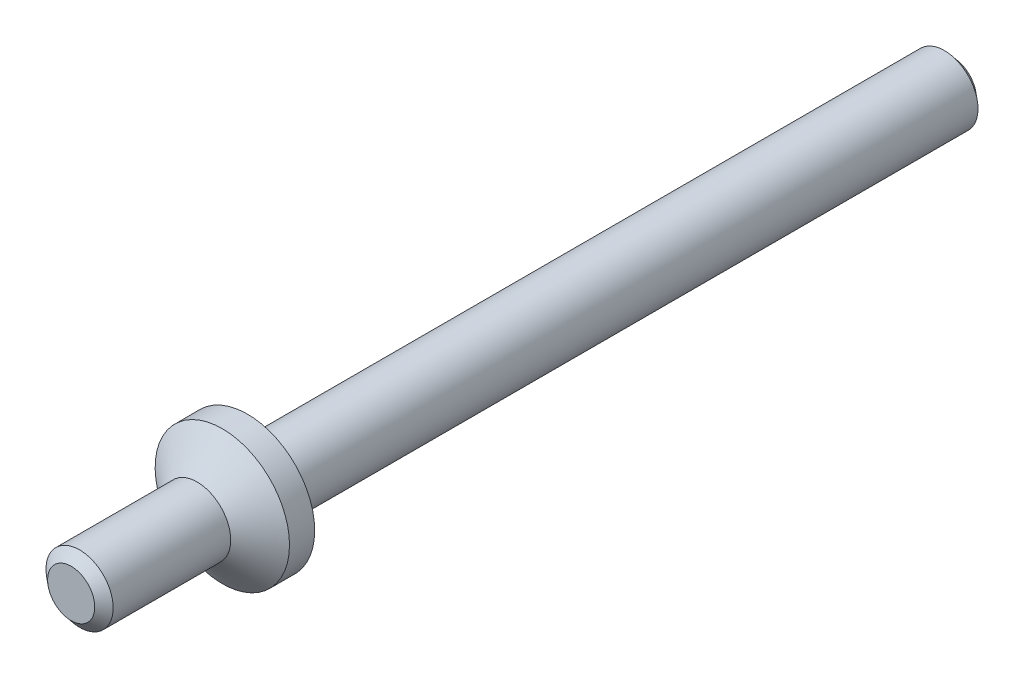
ISO-10303-21;
HEADER;
FILE_DESCRIPTION(('STEP AP214'),'2;1');
FILE_NAME('part.step','',(''),(''),'','','');
FILE_SCHEMA(('AUTOMOTIVE_DESIGN { 1 0 10303 214 1 1 1 1 }'));
ENDSEC;
DATA;
#1=APPLICATION_CONTEXT('core data for automotive mechanical design processes');
#2=APPLICATION_PROTOCOL_DEFINITION('international standard','automotive_design',2000,#1);
#3=PRODUCT_CONTEXT('',#1,'mechanical');
#4=PRODUCT('Part','Part','',(#3));
#5=PRODUCT_RELATED_PRODUCT_CATEGORY('part','',(#4));
#6=PRODUCT_DEFINITION_FORMATION('','',#4);
#7=PRODUCT_DEFINITION_CONTEXT('part definition',#1,'design');
#8=PRODUCT_DEFINITION('design','',#6,#7);
#9=PRODUCT_DEFINITION_SHAPE('','',#8);
#10=(LENGTH_UNIT() NAMED_UNIT(*) SI_UNIT(.MILLI.,.METRE.));
#11=(NAMED_UNIT(*) PLANE_ANGLE_UNIT() SI_UNIT($,.RADIAN.));
#12=(NAMED_UNIT(*) SI_UNIT($,.STERADIAN.) SOLID_ANGLE_UNIT());
#13=UNCERTAINTY_MEASURE_WITH_UNIT(LENGTH_MEASURE(1.E-05),#10,'distance_accuracy_value','');
#14=(GEOMETRIC_REPRESENTATION_CONTEXT(3) GLOBAL_UNCERTAINTY_ASSIGNED_CONTEXT((#13)) GLOBAL_UNIT_ASSIGNED_CONTEXT((#10,
#11,#12)) REPRESENTATION_CONTEXT('',''));
#15=CARTESIAN_POINT('',(0.,0.,0.));
#16=DIRECTION('',(0.,0.,1.));
#17=DIRECTION('',(1.,0.,0.));
#18=AXIS2_PLACEMENT_3D('',#15,#16,#17);
#19=CARTESIAN_POINT('',(0.,0.,-3.));
#20=DIRECTION('',(0.,0.,1.));
#21=DIRECTION('',(1.,0.,0.));
#22=AXIS2_PLACEMENT_3D('',#19,#20,#21);
#23=CYLINDRICAL_SURFACE('',#22,8.);
#24=CARTESIAN_POINT('',(0.,0.,-3.));
#25=DIRECTION('',(0.,0.,1.));
#26=DIRECTION('',(1.,0.,0.));
#27=AXIS2_PLACEMENT_3D('',#24,#25,#26);
#28=CIRCLE('',#27,8.);
#29=CARTESIAN_POINT('',(8.,0.,-3.));
#30=VERTEX_POINT('',#29);
#31=EDGE_CURVE('E78',#30,#30,#28,.T.);
#32=ORIENTED_EDGE('',*,*,#31,.T.);
#33=EDGE_LOOP('',(#32));
#34=FACE_BOUND('',#33,.T.);
#35=CARTESIAN_POINT('',(0.,0.,0.));
#36=DIRECTION('',(0.,0.,1.));
#37=DIRECTION('',(1.,0.,0.));
#38=AXIS2_PLACEMENT_3D('',#35,#36,#37);
#39=CIRCLE('',#38,8.);
#40=CARTESIAN_POINT('',(2.19529297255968,7.69289859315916,0.));
#41=VERTEX_POINT('',#40);
#42=EDGE_CURVE('E64',#41,#41,#39,.T.);
#43=ORIENTED_EDGE('',*,*,#42,.F.);
#44=EDGE_LOOP('',(#43));
#45=FACE_BOUND('',#44,.T.);
#46=ADVANCED_FACE('F38',(#34,#45),#23,.T.);
#47=CARTESIAN_POINT('',(0.,0.,-3.));
#48=DIRECTION('',(0.,0.,1.));
#49=DIRECTION('',(1.,0.,0.));
#50=AXIS2_PLACEMENT_3D('',#47,#48,#49);
#51=PLANE('',#50);
#52=CARTESIAN_POINT('',(0.,0.,-3.));
#53=DIRECTION('',(0.,0.,-1.));
#54=DIRECTION('',(-1.,0.,0.));
#55=AXIS2_PLACEMENT_3D('',#52,#53,#54);
#56=CIRCLE('',#55,4.);
#57=CARTESIAN_POINT('',(4.,0.,-3.));
#58=VERTEX_POINT('',#57);
#59=EDGE_CURVE('E59',#58,#58,#56,.T.);
#60=ORIENTED_EDGE('',*,*,#59,.F.);
#61=EDGE_LOOP('',(#60));
#62=FACE_BOUND('',#61,.T.);
#63=ORIENTED_EDGE('',*,*,#31,.F.);
#64=EDGE_LOOP('',(#63));
#65=FACE_BOUND('',#64,.T.);
#66=ADVANCED_FACE('F104',(#62,#65),#51,.F.);
#67=CARTESIAN_POINT('',(0.,0.,-87.));
#68=DIRECTION('',(0.,0.,1.));
#69=DIRECTION('',(1.,0.,0.));
#70=AXIS2_PLACEMENT_3D('',#67,#68,#69);
#71=CYLINDRICAL_SURFACE('',#70,4.);
#72=CARTESIAN_POINT('',(0.,0.,-86.));
#73=DIRECTION('',(0.,0.,-1.));
#74=DIRECTION('',(-1.,0.,0.));
#75=AXIS2_PLACEMENT_3D('',#72,#73,#74);
#76=CIRCLE('',#75,4.);
#77=CARTESIAN_POINT('',(4.,0.,-86.));
#78=VERTEX_POINT('',#77);
#79=EDGE_CURVE('E50',#78,#78,#76,.F.);
#80=CARTESIAN_POINT('',(4.,0.,-86.));
#81=CARTESIAN_POINT('',(4.,0.,-85.1354166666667));
#82=CARTESIAN_POINT('',(4.,0.,-84.2708333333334));
#83=CARTESIAN_POINT('',(4.,0.,-82.5416666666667));
#84=CARTESIAN_POINT('',(4.,0.,-81.6770833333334));
#85=CARTESIAN_POINT('',(4.,0.,-79.9479166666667));
#86=CARTESIAN_POINT('',(4.,0.,-79.0833333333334));
#87=CARTESIAN_POINT('',(4.,0.,-77.3541666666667));
#88=CARTESIAN_POINT('',(4.,0.,-76.4895833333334));
#89=CARTESIAN_POINT('',(4.,0.,-74.7604166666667));
#90=CARTESIAN_POINT('',(4.,0.,-73.8958333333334));
#91=CARTESIAN_POINT('',(4.,0.,-72.1666666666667));
#92=CARTESIAN_POINT('',(4.,0.,-71.3020833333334));
#93=CARTESIAN_POINT('',(4.,0.,-69.5729166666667));
#94=CARTESIAN_POINT('',(4.,0.,-68.7083333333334));
#95=CARTESIAN_POINT('',(4.,0.,-66.9791666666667));
#96=CARTESIAN_POINT('',(4.,0.,-66.1145833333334));
#97=CARTESIAN_POINT('',(4.,0.,-64.3854166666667));
#98=CARTESIAN_POINT('',(4.,0.,-63.5208333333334));
#99=CARTESIAN_POINT('',(4.,0.,-61.7916666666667));
#100=CARTESIAN_POINT('',(4.,0.,-60.9270833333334));
#101=CARTESIAN_POINT('',(4.,0.,-59.1979166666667));
#102=CARTESIAN_POINT('',(4.,0.,-58.3333333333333));
#103=CARTESIAN_POINT('',(4.,0.,-56.6041666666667));
#104=CARTESIAN_POINT('',(4.,0.,-55.7395833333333));
#105=CARTESIAN_POINT('',(4.,0.,-54.0104166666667));
#106=CARTESIAN_POINT('',(4.,0.,-53.1458333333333));
#107=CARTESIAN_POINT('',(4.,0.,-51.4166666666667));
#108=CARTESIAN_POINT('',(4.,0.,-50.5520833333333));
#109=CARTESIAN_POINT('',(4.,0.,-48.8229166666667));
#110=CARTESIAN_POINT('',(4.,0.,-47.9583333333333));
#111=CARTESIAN_POINT('',(4.,0.,-46.2291666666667));
#112=CARTESIAN_POINT('',(4.,0.,-45.3645833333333));
#113=CARTESIAN_POINT('',(4.,0.,-43.6354166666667));
#114=CARTESIAN_POINT('',(4.,0.,-42.7708333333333));
#115=CARTESIAN_POINT('',(4.,0.,-41.0416666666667));
#116=CARTESIAN_POINT('',(4.,0.,-40.1770833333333));
#117=CARTESIAN_POINT('',(4.,0.,-38.4479166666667));
#118=CARTESIAN_POINT('',(4.,0.,-37.5833333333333));
#119=CARTESIAN_POINT('',(4.,0.,-35.8541666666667));
#120=CARTESIAN_POINT('',(4.,0.,-34.9895833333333));
#121=CARTESIAN_POINT('',(4.,0.,-33.2604166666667));
#122=CARTESIAN_POINT('',(4.,0.,-32.3958333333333));
#123=CARTESIAN_POINT('',(4.,0.,-30.6666666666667));
#124=CARTESIAN_POINT('',(4.,0.,-29.8020833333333));
#125=CARTESIAN_POINT('',(4.,0.,-28.0729166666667));
#126=CARTESIAN_POINT('',(4.,0.,-27.2083333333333));
#127=CARTESIAN_POINT('',(4.,0.,-25.4791666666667));
#128=CARTESIAN_POINT('',(4.,0.,-24.6145833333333));
#129=CARTESIAN_POINT('',(4.,0.,-22.8854166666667));
#130=CARTESIAN_POINT('',(4.,0.,-22.0208333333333));
#131=CARTESIAN_POINT('',(4.,0.,-20.2916666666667));
#132=CARTESIAN_POINT('',(4.,0.,-19.4270833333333));
#133=CARTESIAN_POINT('',(4.,0.,-17.6979166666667));
#134=CARTESIAN_POINT('',(4.,0.,-16.8333333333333));
#135=CARTESIAN_POINT('',(4.,0.,-15.1041666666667));
#136=CARTESIAN_POINT('',(4.,0.,-14.2395833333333));
#137=CARTESIAN_POINT('',(4.,0.,-12.5104166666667));
#138=CARTESIAN_POINT('',(4.,0.,-11.6458333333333));
#139=CARTESIAN_POINT('',(4.,0.,-9.91666666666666));
#140=CARTESIAN_POINT('',(4.,0.,-9.05208333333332));
#141=CARTESIAN_POINT('',(4.,0.,-7.32291666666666));
#142=CARTESIAN_POINT('',(4.,0.,-6.45833333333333));
#143=CARTESIAN_POINT('',(4.,0.,-4.72916666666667));
#144=CARTESIAN_POINT('',(4.,0.,-3.86458333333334));
#145=CARTESIAN_POINT('',(4.,0.,-3.));
#146=B_SPLINE_CURVE_WITH_KNOTS('',3,(#80,#81,#82,#83,#84,#85,#86,#87,#88,#89,#90,#91,#92,#93,
#94,#95,#96,#97,#98,#99,#100,#101,#102,#103,#104,#105,#106,#107,#108,#109,#110,#111,#112,#113,
#114,#115,#116,#117,#118,#119,#120,#121,#122,#123,#124,#125,#126,#127,#128,#129,#130,#131,#132,
#133,#134,#135,#136,#137,#138,#139,#140,#141,#142,#143,#144,#145),.UNSPECIFIED.,.F.,.F.,(4,2,2,
2,2,2,2,2,2,2,2,2,2,2,2,2,2,2,2,2,2,2,2,2,2,2,2,2,2,2,2,2,4),(0.,2.59375000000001,
5.18750000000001,7.78125,10.375,12.96875,15.5625,18.15625,20.75,23.34375,25.9375,28.53125,
31.125,33.71875,36.3125,38.90625,41.5,44.09375,46.6875,49.28125,51.875,54.46875,57.0625,
59.65625,62.25,64.84375,67.4375,70.03125,72.625,75.21875,77.8125,80.40625,83.),.UNSPECIFIED.);
#147=EDGE_CURVE('BSEAM97',#78,#58,#146,.T.);
#148=ORIENTED_EDGE('',*,*,#79,.T.);
#149=ORIENTED_EDGE('',*,*,#59,.T.);
#150=ORIENTED_EDGE('',*,*,#147,.T.);
#151=ORIENTED_EDGE('',*,*,#147,.F.);
#152=EDGE_LOOP('',(#148,#150,#149,#151));
#153=FACE_BOUND('',#152,.T.);
#154=ADVANCED_FACE('F97',(#153),#71,.T.);
#155=CARTESIAN_POINT('',(0.,0.,-87.));
#156=DIRECTION('',(0.,0.,-1.));
#157=DIRECTION('',(-1.,0.,0.));
#158=AXIS2_PLACEMENT_3D('',#155,#156,#157);
#159=PLANE('',#158);
#160=CARTESIAN_POINT('',(0.,0.,-87.));
#161=DIRECTION('',(0.,0.,-1.));
#162=DIRECTION('',(-1.,0.,0.));
#163=AXIS2_PLACEMENT_3D('',#160,#161,#162);
#164=CIRCLE('',#163,2.80824640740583);
#165=CARTESIAN_POINT('',(-2.80824640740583,0.,-87.));
#166=VERTEX_POINT('',#165);
#167=EDGE_CURVE('E54',#166,#166,#164,.T.);
#168=ORIENTED_EDGE('',*,*,#167,.T.);
#169=EDGE_LOOP('',(#168));
#170=FACE_BOUND('',#169,.T.);
#171=ADVANCED_FACE('F90',(#170),#159,.T.);
#172=CARTESIAN_POINT('',(2.19529297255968,7.69289859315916,0.));
#173=CARTESIAN_POINT('',(1.97965117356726,3.47577059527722,3.));
#174=CARTESIAN_POINT('',(-13.1905042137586,12.0834845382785,0.));
#175=CARTESIAN_POINT('',(-4.97189001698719,7.43507294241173,3.));
#176=CARTESIAN_POINT('',(-17.581090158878,-3.30231264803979,0.));
#177=CARTESIAN_POINT('',(-8.9311923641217,0.483531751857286,3.));
#178=CARTESIAN_POINT('',(-2.19529297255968,-7.69289859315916,0.));
#179=CARTESIAN_POINT('',(-1.97965117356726,-3.47577059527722,3.));
#180=CARTESIAN_POINT('',(13.1905042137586,-12.0834845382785,0.));
#181=CARTESIAN_POINT('',(4.97189001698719,-7.43507294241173,3.));
#182=CARTESIAN_POINT('',(17.581090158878,3.3023126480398,0.));
#183=CARTESIAN_POINT('',(8.9311923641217,-0.483531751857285,3.));
#184=CARTESIAN_POINT('',(2.19529297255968,7.69289859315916,0.));
#185=CARTESIAN_POINT('',(1.97965117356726,3.47577059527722,3.));
#186=(BOUNDED_SURFACE() B_SPLINE_SURFACE(3,1,((#172,#173),(#174,#175),(#176,#177),(#178,#179),
(#180,#181),(#182,#183),(#184,#185)),.UNSPECIFIED.,.T.,.F.,.F.) B_SPLINE_SURFACE_WITH_KNOTS((4,
3,4),(2,2),(0.,0.5,1.),(0.,1.),
.UNSPECIFIED.) GEOMETRIC_REPRESENTATION_ITEM() RATIONAL_B_SPLINE_SURFACE(((1.,1.),
(0.333333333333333,0.333333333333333),(0.333333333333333,0.333333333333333),(1.,1.),
(0.333333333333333,0.333333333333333),(0.333333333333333,0.333333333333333),(1.,1.))) REPRESENTATION_ITEM('') SURFACE());
#187=CARTESIAN_POINT('',(0.,0.,3.));
#188=DIRECTION('',(0.,0.,1.));
#189=DIRECTION('',(1.,0.,0.));
#190=AXIS2_PLACEMENT_3D('',#187,#188,#189);
#191=CIRCLE('',#190,4.);
#192=CARTESIAN_POINT('',(1.97965117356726,3.47577059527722,3.));
#193=VERTEX_POINT('',#192);
#194=EDGE_CURVE('E60',#193,#193,#191,.T.);
#195=CARTESIAN_POINT('',(2.19529297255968,7.69289859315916,0.));
#196=CARTESIAN_POINT('',(2.19304670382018,7.64897017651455,0.03125));
#197=CARTESIAN_POINT('',(2.19080043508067,7.60504175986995,0.0625));
#198=CARTESIAN_POINT('',(2.18630789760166,7.51718492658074,0.125));
#199=CARTESIAN_POINT('',(2.18406162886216,7.47325650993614,0.15625));
#200=CARTESIAN_POINT('',(2.17956909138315,7.38539967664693,0.21875));
#201=CARTESIAN_POINT('',(2.17732282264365,7.34147126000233,0.25));
#202=CARTESIAN_POINT('',(2.17283028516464,7.25361442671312,0.3125));
#203=CARTESIAN_POINT('',(2.17058401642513,7.20968601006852,0.34375));
#204=CARTESIAN_POINT('',(2.16609147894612,7.12182917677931,0.40625));
#205=CARTESIAN_POINT('',(2.16384521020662,7.07790076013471,0.4375));
#206=CARTESIAN_POINT('',(2.15935267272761,6.9900439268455,0.5));
#207=CARTESIAN_POINT('',(2.1571064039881,6.9461155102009,0.53125));
#208=CARTESIAN_POINT('',(2.1526138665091,6.85825867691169,0.59375));
#209=CARTESIAN_POINT('',(2.15036759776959,6.81433026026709,0.625));
#210=CARTESIAN_POINT('',(2.14587506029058,6.72647342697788,0.6875));
#211=CARTESIAN_POINT('',(2.14362879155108,6.68254501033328,0.71875));
#212=CARTESIAN_POINT('',(2.13913625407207,6.59468817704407,0.78125));
#213=CARTESIAN_POINT('',(2.13688998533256,6.55075976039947,0.8125));
#214=CARTESIAN_POINT('',(2.13239744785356,6.46290292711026,0.875));
#215=CARTESIAN_POINT('',(2.13015117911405,6.41897451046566,0.90625));
#216=CARTESIAN_POINT('',(2.12565864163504,6.33111767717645,0.96875));
#217=CARTESIAN_POINT('',(2.12341237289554,6.28718926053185,1.));
#218=CARTESIAN_POINT('',(2.11891983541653,6.19933242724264,1.0625));
#219=CARTESIAN_POINT('',(2.11667356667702,6.15540401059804,1.09375));
#220=CARTESIAN_POINT('',(2.11218102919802,6.06754717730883,1.15625));
#221=CARTESIAN_POINT('',(2.10993476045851,6.02361876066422,1.1875));
#222=CARTESIAN_POINT('',(2.1054422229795,5.93576192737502,1.25));
#223=CARTESIAN_POINT('',(2.10319595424,5.89183351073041,1.28125));
#224=CARTESIAN_POINT('',(2.09870341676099,5.80397667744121,1.34375));
#225=CARTESIAN_POINT('',(2.09645714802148,5.7600482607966,1.375));
#226=CARTESIAN_POINT('',(2.09196461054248,5.6721914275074,1.4375));
#227=CARTESIAN_POINT('',(2.08971834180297,5.62826301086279,1.46875));
#228=CARTESIAN_POINT('',(2.08522580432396,5.54040617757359,1.53125));
#229=CARTESIAN_POINT('',(2.08297953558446,5.49647776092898,1.5625));
#230=CARTESIAN_POINT('',(2.07848699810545,5.40862092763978,1.625));
#231=CARTESIAN_POINT('',(2.07624072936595,5.36469251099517,1.65625));
#232=CARTESIAN_POINT('',(2.07174819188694,5.27683567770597,1.71875));
#233=CARTESIAN_POINT('',(2.06950192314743,5.23290726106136,1.75));
#234=CARTESIAN_POINT('',(2.06500938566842,5.14505042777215,1.8125));
#235=CARTESIAN_POINT('',(2.06276311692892,5.10112201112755,1.84375));
#236=CARTESIAN_POINT('',(2.05827057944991,5.01326517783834,1.90625));
#237=CARTESIAN_POINT('',(2.05602431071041,4.96933676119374,1.9375));
#238=CARTESIAN_POINT('',(2.0515317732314,4.88147992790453,2.));
#239=CARTESIAN_POINT('',(2.04928550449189,4.83755151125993,2.03125));
#240=CARTESIAN_POINT('',(2.04479296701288,4.74969467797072,2.09375));
#241=CARTESIAN_POINT('',(2.04254669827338,4.70576626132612,2.125));
#242=CARTESIAN_POINT('',(2.03805416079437,4.61790942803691,2.1875));
#243=CARTESIAN_POINT('',(2.03580789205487,4.57398101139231,2.21875));
#244=CARTESIAN_POINT('',(2.03131535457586,4.4861241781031,2.28125));
#245=CARTESIAN_POINT('',(2.02906908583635,4.4421957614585,2.3125));
#246=CARTESIAN_POINT('',(2.02457654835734,4.35433892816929,2.375));
#247=CARTESIAN_POINT('',(2.02233027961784,4.31041051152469,2.40625));
#248=CARTESIAN_POINT('',(2.01783774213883,4.22255367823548,2.46875));
#249=CARTESIAN_POINT('',(2.01559147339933,4.17862526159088,2.5));
#250=CARTESIAN_POINT('',(2.01109893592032,4.09076842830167,2.5625));
#251=CARTESIAN_POINT('',(2.00885266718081,4.04684001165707,2.59375));
#252=CARTESIAN_POINT('',(2.0043601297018,3.95898317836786,2.65625));
#253=CARTESIAN_POINT('',(2.0021138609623,3.91505476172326,2.6875));
#254=CARTESIAN_POINT('',(1.99762132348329,3.82719792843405,2.75));
#255=CARTESIAN_POINT('',(1.99537505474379,3.78326951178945,2.78125));
#256=CARTESIAN_POINT('',(1.99088251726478,3.69541267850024,2.84375));
#257=CARTESIAN_POINT('',(1.98863624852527,3.65148426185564,2.875));
#258=CARTESIAN_POINT('',(1.98414371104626,3.56362742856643,2.9375));
#259=CARTESIAN_POINT('',(1.98189744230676,3.51969901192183,2.96875));
#260=CARTESIAN_POINT('',(1.97965117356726,3.47577059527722,3.));
#261=B_SPLINE_CURVE_WITH_KNOTS('',3,(#195,#196,#197,#198,#199,#200,#201,#202,#203,#204,#205,
#206,#207,#208,#209,#210,#211,#212,#213,#214,#215,#216,#217,#218,#219,#220,#221,#222,#223,#224,
#225,#226,#227,#228,#229,#230,#231,#232,#233,#234,#235,#236,#237,#238,#239,#240,#241,#242,#243,
#244,#245,#246,#247,#248,#249,#250,#251,#252,#253,#254,#255,#256,#257,#258,#259,#260),
.UNSPECIFIED.,.F.,.F.,(4,2,2,2,2,2,2,2,2,2,2,2,2,2,2,2,2,2,2,2,2,2,2,2,2,2,2,2,2,2,2,2,4),(0.,
0.161869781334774,0.323739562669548,0.485609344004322,0.647479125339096,0.80934890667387,
0.971218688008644,1.13308846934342,1.29495825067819,1.45682803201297,1.61869781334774,
1.78056759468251,1.94243737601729,2.10430715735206,2.26617693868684,2.42804672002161,
2.58991650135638,2.75178628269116,2.91365606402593,3.07552584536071,3.23739562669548,
3.39926540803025,3.56113518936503,3.7230049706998,3.88487475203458,4.04674453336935,
4.20861431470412,4.3704840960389,4.53235387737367,4.69422365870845,4.85609344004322,
5.01796322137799,5.17983300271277),.UNSPECIFIED.);
#262=EDGE_CURVE('BSEAM88',#41,#193,#261,.T.);
#263=ORIENTED_EDGE('',*,*,#42,.T.);
#264=ORIENTED_EDGE('',*,*,#194,.F.);
#265=ORIENTED_EDGE('',*,*,#262,.T.);
#266=ORIENTED_EDGE('',*,*,#262,.F.);
#267=EDGE_LOOP('',(#263,#265,#264,#266));
#268=FACE_BOUND('',#267,.T.);
#269=ADVANCED_FACE('F88',(#268),#186,.T.);
#270=CARTESIAN_POINT('',(0.,0.,18.));
#271=DIRECTION('',(0.,0.,-1.));
#272=DIRECTION('',(-1.,0.,0.));
#273=AXIS2_PLACEMENT_3D('',#270,#271,#272);
#274=CYLINDRICAL_SURFACE('',#273,4.);
#275=CARTESIAN_POINT('',(0.,0.,17.));
#276=DIRECTION('',(0.,0.,1.));
#277=DIRECTION('',(1.,0.,0.));
#278=AXIS2_PLACEMENT_3D('',#275,#276,#277);
#279=CIRCLE('',#278,4.);
#280=CARTESIAN_POINT('',(4.,0.,17.));
#281=VERTEX_POINT('',#280);
#282=EDGE_CURVE('E11',#281,#281,#279,.F.);
#283=ORIENTED_EDGE('',*,*,#282,.T.);
#284=EDGE_LOOP('',(#283));
#285=FACE_BOUND('',#284,.T.);
#286=ORIENTED_EDGE('',*,*,#194,.T.);
#287=EDGE_LOOP('',(#286));
#288=FACE_BOUND('',#287,.T.);
#289=ADVANCED_FACE('F86',(#285,#288),#274,.T.);
#290=CARTESIAN_POINT('',(0.,0.,18.));
#291=DIRECTION('',(0.,0.,1.));
#292=DIRECTION('',(1.,0.,0.));
#293=AXIS2_PLACEMENT_3D('',#290,#291,#292);
#294=PLANE('',#293);
#295=CARTESIAN_POINT('',(0.,0.,18.));
#296=DIRECTION('',(0.,0.,1.));
#297=DIRECTION('',(1.,0.,0.));
#298=AXIS2_PLACEMENT_3D('',#295,#296,#297);
#299=CIRCLE('',#298,2.80824640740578);
#300=CARTESIAN_POINT('',(2.80824640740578,0.,18.));
#301=VERTEX_POINT('',#300);
#302=EDGE_CURVE('E46',#301,#301,#299,.T.);
#303=ORIENTED_EDGE('',*,*,#302,.T.);
#304=EDGE_LOOP('',(#303));
#305=FACE_BOUND('',#304,.T.);
#306=ADVANCED_FACE('F96',(#305),#294,.T.);
#307=CARTESIAN_POINT('',(0.,0.,-87.));
#308=DIRECTION('',(0.,0.,1.));
#309=DIRECTION('',(1.,0.,0.));
#310=AXIS2_PLACEMENT_3D('',#307,#308,#309);
#311=CONICAL_SURFACE('',#310,2.80824640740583,0.872664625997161);
#312=ORIENTED_EDGE('',*,*,#79,.F.);
#313=EDGE_LOOP('',(#312));
#314=FACE_BOUND('',#313,.T.);
#315=ORIENTED_EDGE('',*,*,#167,.F.);
#316=EDGE_LOOP('',(#315));
#317=FACE_BOUND('',#316,.T.);
#318=ADVANCED_FACE('F115',(#314,#317),#311,.T.);
#319=CARTESIAN_POINT('',(0.,0.,18.));
#320=DIRECTION('',(0.,0.,-1.));
#321=DIRECTION('',(-1.,0.,0.));
#322=AXIS2_PLACEMENT_3D('',#319,#320,#321);
#323=CONICAL_SURFACE('',#322,2.80824640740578,0.872664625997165);
#324=ORIENTED_EDGE('',*,*,#282,.F.);
#325=EDGE_LOOP('',(#324));
#326=FACE_BOUND('',#325,.T.);
#327=ORIENTED_EDGE('',*,*,#302,.F.);
#328=EDGE_LOOP('',(#327));
#329=FACE_BOUND('',#328,.T.);
#330=ADVANCED_FACE('F41',(#326,#329),#323,.T.);
#331=CLOSED_SHELL('',(#46,#66,#154,#171,#269,#289,#306,#318,#330));
#332=MANIFOLD_SOLID_BREP('B2',#331);
#333=ADVANCED_BREP_SHAPE_REPRESENTATION('',(#18,#332),#14);
#334=SHAPE_DEFINITION_REPRESENTATION(#9,#333);
ENDSEC;
END-ISO-10303-21;
